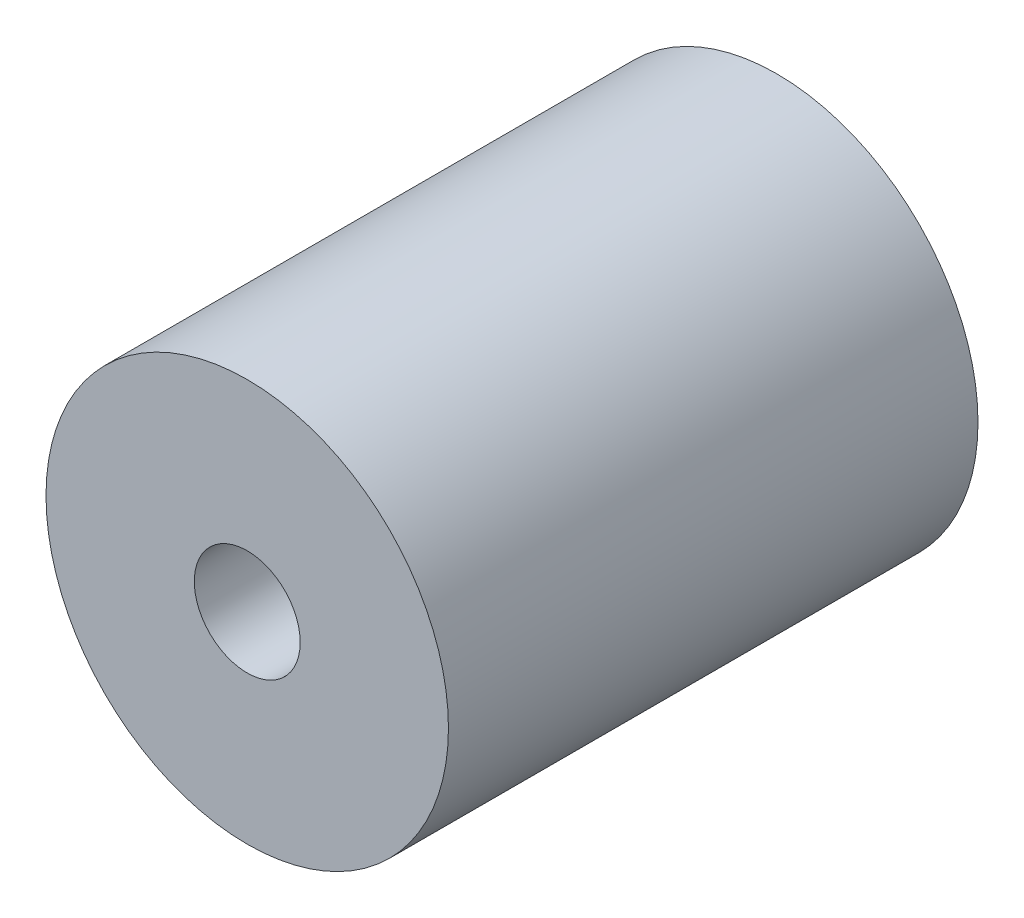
ISO-10303-21;
HEADER;
FILE_DESCRIPTION(('STEP AP214'),'2;1');
FILE_NAME('part.step','',(''),(''),'','','');
FILE_SCHEMA(('AUTOMOTIVE_DESIGN { 1 0 10303 214 1 1 1 1 }'));
ENDSEC;
DATA;
#1=APPLICATION_CONTEXT('core data for automotive mechanical design processes');
#2=APPLICATION_PROTOCOL_DEFINITION('international standard','automotive_design',2000,#1);
#3=PRODUCT_CONTEXT('',#1,'mechanical');
#4=PRODUCT('Part','Part','',(#3));
#5=PRODUCT_RELATED_PRODUCT_CATEGORY('part','',(#4));
#6=PRODUCT_DEFINITION_FORMATION('','',#4);
#7=PRODUCT_DEFINITION_CONTEXT('part definition',#1,'design');
#8=PRODUCT_DEFINITION('design','',#6,#7);
#9=PRODUCT_DEFINITION_SHAPE('','',#8);
#10=(LENGTH_UNIT() NAMED_UNIT(*) SI_UNIT(.MILLI.,.METRE.));
#11=(NAMED_UNIT(*) PLANE_ANGLE_UNIT() SI_UNIT($,.RADIAN.));
#12=(NAMED_UNIT(*) SI_UNIT($,.STERADIAN.) SOLID_ANGLE_UNIT());
#13=UNCERTAINTY_MEASURE_WITH_UNIT(LENGTH_MEASURE(1.E-05),#10,'distance_accuracy_value','');
#14=(GEOMETRIC_REPRESENTATION_CONTEXT(3) GLOBAL_UNCERTAINTY_ASSIGNED_CONTEXT((#13)) GLOBAL_UNIT_ASSIGNED_CONTEXT((#10,
#11,#12)) REPRESENTATION_CONTEXT('',''));
#15=CARTESIAN_POINT('',(0.,0.,0.));
#16=DIRECTION('',(0.,0.,1.));
#17=DIRECTION('',(1.,0.,0.));
#18=AXIS2_PLACEMENT_3D('',#15,#16,#17);
#19=CARTESIAN_POINT('',(0.,0.,25.));
#20=DIRECTION('',(0.,0.,-1.));
#21=DIRECTION('',(-1.,0.,0.));
#22=AXIS2_PLACEMENT_3D('',#19,#20,#21);
#23=CYLINDRICAL_SURFACE('',#22,2.);
#24=CARTESIAN_POINT('',(0.,0.,0.));
#25=DIRECTION('',(0.,0.,1.));
#26=DIRECTION('',(1.,0.,0.));
#27=AXIS2_PLACEMENT_3D('',#24,#25,#26);
#28=CIRCLE('',#27,2.);
#29=CARTESIAN_POINT('',(2.,0.,0.));
#30=VERTEX_POINT('',#29);
#31=EDGE_CURVE('E52',#30,#30,#28,.T.);
#32=ORIENTED_EDGE('',*,*,#31,.F.);
#33=EDGE_LOOP('',(#32));
#34=FACE_BOUND('',#33,.T.);
#35=CARTESIAN_POINT('',(0.,0.,10.));
#36=DIRECTION('',(0.,0.,1.));
#37=DIRECTION('',(1.,0.,0.));
#38=AXIS2_PLACEMENT_3D('',#35,#36,#37);
#39=CIRCLE('',#38,2.);
#40=CARTESIAN_POINT('',(2.,0.,10.));
#41=VERTEX_POINT('',#40);
#42=EDGE_CURVE('E41',#41,#41,#39,.T.);
#43=ORIENTED_EDGE('',*,*,#42,.T.);
#44=EDGE_LOOP('',(#43));
#45=FACE_BOUND('',#44,.T.);
#46=ADVANCED_FACE('F37',(#34,#45),#23,.F.);
#47=CARTESIAN_POINT('',(0.,0.,25.));
#48=DIRECTION('',(0.,0.,1.));
#49=DIRECTION('',(1.,0.,0.));
#50=AXIS2_PLACEMENT_3D('',#47,#48,#49);
#51=PLANE('',#50);
#52=CARTESIAN_POINT('',(0.,0.,25.));
#53=DIRECTION('',(0.,0.,1.));
#54=DIRECTION('',(1.,0.,0.));
#55=AXIS2_PLACEMENT_3D('',#52,#53,#54);
#56=CIRCLE('',#55,2.5);
#57=CARTESIAN_POINT('',(2.5,0.,25.));
#58=VERTEX_POINT('',#57);
#59=EDGE_CURVE('E57',#58,#58,#56,.T.);
#60=ORIENTED_EDGE('',*,*,#59,.F.);
#61=EDGE_LOOP('',(#60));
#62=FACE_BOUND('',#61,.T.);
#63=CARTESIAN_POINT('',(0.,0.,25.));
#64=DIRECTION('',(0.,0.,1.));
#65=DIRECTION('',(1.,0.,0.));
#66=AXIS2_PLACEMENT_3D('',#63,#64,#65);
#67=CIRCLE('',#66,9.5);
#68=CARTESIAN_POINT('',(9.5,0.,25.));
#69=VERTEX_POINT('',#68);
#70=EDGE_CURVE('E10',#69,#69,#67,.T.);
#71=ORIENTED_EDGE('',*,*,#70,.T.);
#72=EDGE_LOOP('',(#71));
#73=FACE_BOUND('',#72,.T.);
#74=ADVANCED_FACE('F81',(#62,#73),#51,.T.);
#75=CARTESIAN_POINT('',(0.,0.,0.));
#76=DIRECTION('',(0.,0.,1.));
#77=DIRECTION('',(1.,0.,0.));
#78=AXIS2_PLACEMENT_3D('',#75,#76,#77);
#79=PLANE('',#78);
#80=CARTESIAN_POINT('',(0.,0.,0.));
#81=DIRECTION('',(0.,0.,1.));
#82=DIRECTION('',(1.,0.,0.));
#83=AXIS2_PLACEMENT_3D('',#80,#81,#82);
#84=CIRCLE('',#83,9.5);
#85=CARTESIAN_POINT('',(9.5,0.,0.));
#86=VERTEX_POINT('',#85);
#87=EDGE_CURVE('E46',#86,#86,#84,.T.);
#88=ORIENTED_EDGE('',*,*,#87,.F.);
#89=EDGE_LOOP('',(#88));
#90=FACE_BOUND('',#89,.T.);
#91=ORIENTED_EDGE('',*,*,#31,.T.);
#92=EDGE_LOOP('',(#91));
#93=FACE_BOUND('',#92,.T.);
#94=ADVANCED_FACE('F87',(#90,#93),#79,.F.);
#95=CARTESIAN_POINT('',(0.,0.,25.));
#96=DIRECTION('',(0.,0.,-1.));
#97=DIRECTION('',(-1.,0.,0.));
#98=AXIS2_PLACEMENT_3D('',#95,#96,#97);
#99=CYLINDRICAL_SURFACE('',#98,9.5);
#100=ORIENTED_EDGE('',*,*,#70,.F.);
#101=EDGE_LOOP('',(#100));
#102=FACE_BOUND('',#101,.T.);
#103=ORIENTED_EDGE('',*,*,#87,.T.);
#104=EDGE_LOOP('',(#103));
#105=FACE_BOUND('',#104,.T.);
#106=ADVANCED_FACE('F39',(#102,#105),#99,.T.);
#107=CARTESIAN_POINT('',(0.,0.,10.));
#108=DIRECTION('',(0.,0.,1.));
#109=DIRECTION('',(1.,0.,0.));
#110=AXIS2_PLACEMENT_3D('',#107,#108,#109);
#111=CYLINDRICAL_SURFACE('',#110,2.5);
#112=CARTESIAN_POINT('',(0.,0.,10.));
#113=DIRECTION('',(0.,0.,1.));
#114=DIRECTION('',(1.,0.,0.));
#115=AXIS2_PLACEMENT_3D('',#112,#113,#114);
#116=CIRCLE('',#115,2.5);
#117=CARTESIAN_POINT('',(2.5,0.,10.));
#118=VERTEX_POINT('',#117);
#119=EDGE_CURVE('E61',#118,#118,#116,.T.);
#120=ORIENTED_EDGE('',*,*,#119,.F.);
#121=EDGE_LOOP('',(#120));
#122=FACE_BOUND('',#121,.T.);
#123=ORIENTED_EDGE('',*,*,#59,.T.);
#124=EDGE_LOOP('',(#123));
#125=FACE_BOUND('',#124,.T.);
#126=ADVANCED_FACE('F73',(#122,#125),#111,.F.);
#127=CARTESIAN_POINT('',(0.,0.,10.));
#128=DIRECTION('',(0.,0.,1.));
#129=DIRECTION('',(1.,0.,0.));
#130=AXIS2_PLACEMENT_3D('',#127,#128,#129);
#131=PLANE('',#130);
#132=ORIENTED_EDGE('',*,*,#42,.F.);
#133=EDGE_LOOP('',(#132));
#134=FACE_BOUND('',#133,.T.);
#135=ORIENTED_EDGE('',*,*,#119,.T.);
#136=EDGE_LOOP('',(#135));
#137=FACE_BOUND('',#136,.T.);
#138=ADVANCED_FACE('F71',(#134,#137),#131,.T.);
#139=CLOSED_SHELL('',(#46,#74,#94,#106,#126,#138));
#140=MANIFOLD_SOLID_BREP('B2',#139);
#141=ADVANCED_BREP_SHAPE_REPRESENTATION('',(#18,#140),#14);
#142=SHAPE_DEFINITION_REPRESENTATION(#9,#141);
ENDSEC;
END-ISO-10303-21;
